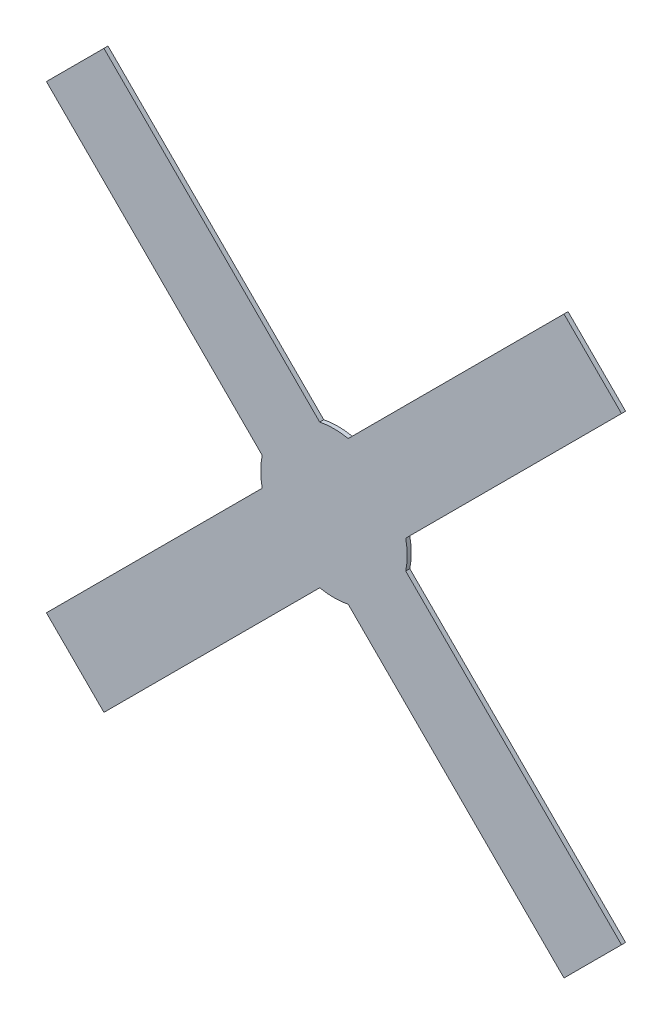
from build123d import *

# Parameters (mm, degrees)
BOSS_EXTRU_1_DEPTH = 5


with BuildPart() as part:
    # Esquisse1 → Boss.-Extru.1 (new body)
    with BuildSketch(Plane.XY):
        with BuildLine():
            Line((-88.270365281, 17.559687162), (-353.553390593, 282.842712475))
            Line((-353.553390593, 282.842712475), (-282.842712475, 353.553390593))
            Line((-282.842712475, 353.553390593), (-17.559687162, 88.270365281))
            ThreePointArc((-17.559687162, 88.270365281), (0, 90), (17.559687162, 88.270365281))
            Line((17.559687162, 88.270365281), (282.842712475, 353.553390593))
            Line((282.842712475, 353.553390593), (353.553390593, 282.842712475))
            Line((353.553390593, 282.842712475), (88.270365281, 17.559687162))
            ThreePointArc((88.270365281, 17.559687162), (90, 0), (88.270365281, -17.559687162))
            Line((88.270365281, -17.559687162), (353.553390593, -282.842712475))
            Line((353.553390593, -282.842712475), (282.842712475, -353.553390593))
            Line((282.842712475, -353.553390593), (17.559687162, -88.270365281))
            ThreePointArc((17.559687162, -88.270365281), (0, -90), (-17.559687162, -88.270365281))
            Line((-17.559687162, -88.270365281), (-282.842712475, -353.553390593))
            Line((-282.842712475, -353.553390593), (-353.553390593, -282.842712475))
            Line((-353.553390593, -282.842712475), (-88.270365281, -17.559687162))
            ThreePointArc((-88.270365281, -17.559687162), (-90, 0), (-88.270365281, 17.559687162))
        make_face()
    extrude(amount=BOSS_EXTRU_1_DEPTH)


solid = part.part
